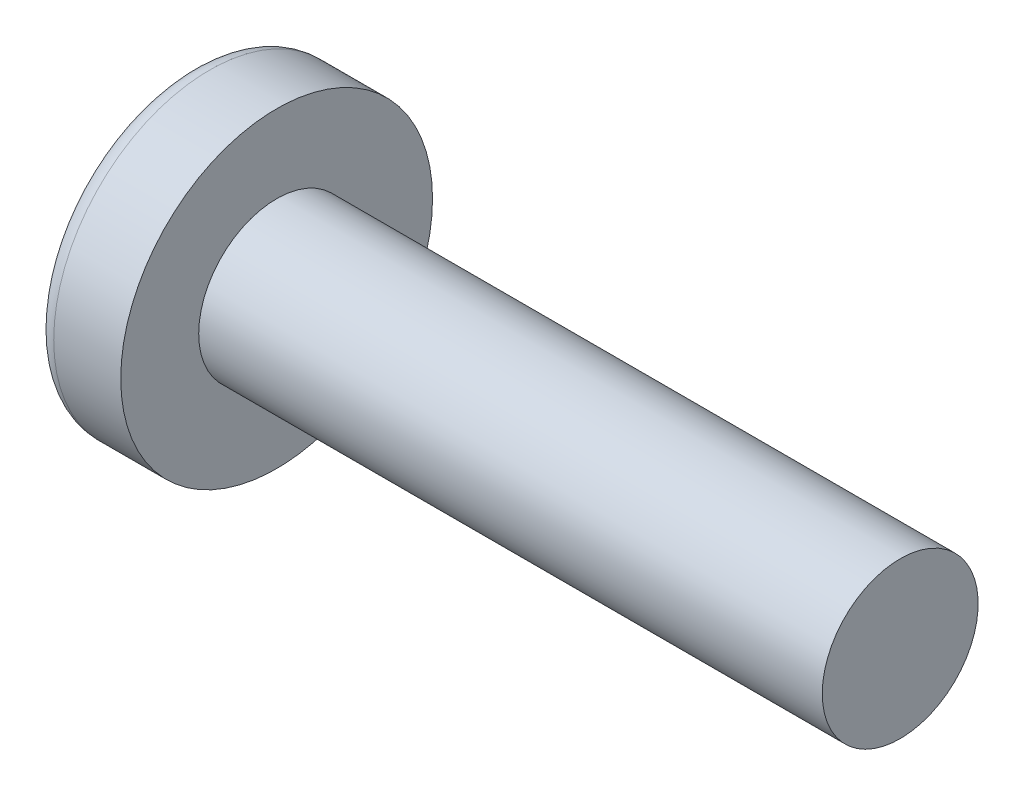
ISO-10303-21;
HEADER;
FILE_DESCRIPTION(('STEP AP214'),'2;1');
FILE_NAME('part.step','',(''),(''),'','','');
FILE_SCHEMA(('AUTOMOTIVE_DESIGN { 1 0 10303 214 1 1 1 1 }'));
ENDSEC;
DATA;
#1=APPLICATION_CONTEXT('core data for automotive mechanical design processes');
#2=APPLICATION_PROTOCOL_DEFINITION('international standard','automotive_design',2000,#1);
#3=PRODUCT_CONTEXT('',#1,'mechanical');
#4=PRODUCT('Part','Part','',(#3));
#5=PRODUCT_RELATED_PRODUCT_CATEGORY('part','',(#4));
#6=PRODUCT_DEFINITION_FORMATION('','',#4);
#7=PRODUCT_DEFINITION_CONTEXT('part definition',#1,'design');
#8=PRODUCT_DEFINITION('design','',#6,#7);
#9=PRODUCT_DEFINITION_SHAPE('','',#8);
#10=(LENGTH_UNIT() NAMED_UNIT(*) SI_UNIT(.MILLI.,.METRE.));
#11=(NAMED_UNIT(*) PLANE_ANGLE_UNIT() SI_UNIT($,.RADIAN.));
#12=(NAMED_UNIT(*) SI_UNIT($,.STERADIAN.) SOLID_ANGLE_UNIT());
#13=UNCERTAINTY_MEASURE_WITH_UNIT(LENGTH_MEASURE(1.E-05),#10,'distance_accuracy_value','');
#14=(GEOMETRIC_REPRESENTATION_CONTEXT(3) GLOBAL_UNCERTAINTY_ASSIGNED_CONTEXT((#13)) GLOBAL_UNIT_ASSIGNED_CONTEXT((#10,
#11,#12)) REPRESENTATION_CONTEXT('',''));
#15=CARTESIAN_POINT('',(0.,0.,0.));
#16=DIRECTION('',(0.,0.,1.));
#17=DIRECTION('',(1.,0.,0.));
#18=AXIS2_PLACEMENT_3D('',#15,#16,#17);
#19=CARTESIAN_POINT('',(4.,0.,0.));
#20=DIRECTION('',(-1.,0.,0.));
#21=DIRECTION('',(0.,1.,0.));
#22=AXIS2_PLACEMENT_3D('',#19,#20,#21);
#23=SPHERICAL_SURFACE('',#22,4.);
#24=CARTESIAN_POINT('',(0.783897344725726,0.,0.));
#25=DIRECTION('',(-1.,0.,0.));
#26=DIRECTION('',(0.,0.,1.));
#27=AXIS2_PLACEMENT_3D('',#24,#25,#26);
#28=CIRCLE('',#27,2.37837837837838);
#29=CARTESIAN_POINT('',(0.783897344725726,0.,2.37837837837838));
#30=VERTEX_POINT('',#29);
#31=EDGE_CURVE('E151',#30,#30,#28,.T.);
#32=ORIENTED_EDGE('',*,*,#31,.T.);
#33=EDGE_LOOP('',(#32));
#34=FACE_BOUND('',#33,.T.);
#35=CARTESIAN_POINT('',(3.98786118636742,-0.106127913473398,0.));
#36=DIRECTION('',(-0.11363816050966,-0.993522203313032,0.));
#37=DIRECTION('',(0.993522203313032,-0.11363816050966,0.));
#38=AXIS2_PLACEMENT_3D('',#35,#36,#37);
#39=CIRCLE('',#38,3.99857343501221);
#40=CARTESIAN_POINT('',(0.195539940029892,0.327634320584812,1.19110847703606));
#41=VERTEX_POINT('',#40);
#42=CARTESIAN_POINT('',(0.0301382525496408,0.346552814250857,0.346552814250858));
#43=VERTEX_POINT('',#42);
#44=EDGE_CURVE('E182',#41,#43,#39,.T.);
#45=ORIENTED_EDGE('',*,*,#44,.F.);
#46=CARTESIAN_POINT('',(3.17784904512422,0.,-1.07973473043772));
#47=DIRECTION('',(0.605808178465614,0.,0.795610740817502));
#48=DIRECTION('',(0.795610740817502,0.,-0.605808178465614));
#49=AXIS2_PLACEMENT_3D('',#46,#47,#48);
#50=CIRCLE('',#49,3.76274377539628);
#51=CARTESIAN_POINT('',(0.195539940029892,-0.327634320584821,1.19110847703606));
#52=VERTEX_POINT('',#51);
#53=EDGE_CURVE('E147',#41,#52,#50,.T.);
#54=ORIENTED_EDGE('',*,*,#53,.T.);
#55=CARTESIAN_POINT('',(3.98786118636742,0.106127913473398,0.));
#56=DIRECTION('',(-0.11363816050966,0.993522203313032,0.));
#57=DIRECTION('',(-0.993522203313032,-0.11363816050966,0.));
#58=AXIS2_PLACEMENT_3D('',#55,#56,#57);
#59=CIRCLE('',#58,3.99857343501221);
#60=CARTESIAN_POINT('',(0.0301382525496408,-0.346552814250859,0.346552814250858));
#61=VERTEX_POINT('',#60);
#62=EDGE_CURVE('E103',#61,#52,#59,.T.);
#63=ORIENTED_EDGE('',*,*,#62,.F.);
#64=CARTESIAN_POINT('',(3.98786118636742,0.,-0.106127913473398));
#65=DIRECTION('',(-0.11363816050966,0.,-0.993522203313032));
#66=DIRECTION('',(-0.993522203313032,0.,0.11363816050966));
#67=AXIS2_PLACEMENT_3D('',#64,#65,#66);
#68=CIRCLE('',#67,3.99857343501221);
#69=CARTESIAN_POINT('',(0.195539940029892,-1.19110847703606,0.327634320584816));
#70=VERTEX_POINT('',#69);
#71=EDGE_CURVE('E128',#70,#61,#68,.T.);
#72=ORIENTED_EDGE('',*,*,#71,.F.);
#73=CARTESIAN_POINT('',(3.17784904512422,1.07973473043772,0.));
#74=DIRECTION('',(0.605808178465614,-0.795610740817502,0.));
#75=DIRECTION('',(0.795610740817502,0.605808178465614,0.));
#76=AXIS2_PLACEMENT_3D('',#73,#74,#75);
#77=CIRCLE('',#76,3.76274377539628);
#78=CARTESIAN_POINT('',(0.195539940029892,-1.19110847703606,-0.327634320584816));
#79=VERTEX_POINT('',#78);
#80=EDGE_CURVE('E136',#70,#79,#77,.T.);
#81=ORIENTED_EDGE('',*,*,#80,.T.);
#82=CARTESIAN_POINT('',(3.98786118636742,0.,0.106127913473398));
#83=DIRECTION('',(-0.11363816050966,0.,0.993522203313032));
#84=DIRECTION('',(0.993522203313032,0.,0.11363816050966));
#85=AXIS2_PLACEMENT_3D('',#82,#83,#84);
#86=CIRCLE('',#85,3.99857343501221);
#87=CARTESIAN_POINT('',(0.0301382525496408,-0.346552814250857,-0.346552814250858));
#88=VERTEX_POINT('',#87);
#89=EDGE_CURVE('E46',#88,#79,#86,.T.);
#90=ORIENTED_EDGE('',*,*,#89,.F.);
#91=CARTESIAN_POINT('',(0.195539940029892,-0.327634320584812,-1.19110847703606));
#92=VERTEX_POINT('',#91);
#93=EDGE_CURVE('E189',#92,#88,#59,.T.);
#94=ORIENTED_EDGE('',*,*,#93,.F.);
#95=CARTESIAN_POINT('',(3.17784904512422,0.,1.07973473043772));
#96=DIRECTION('',(0.605808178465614,0.,-0.795610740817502));
#97=DIRECTION('',(-0.795610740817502,0.,-0.605808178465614));
#98=AXIS2_PLACEMENT_3D('',#95,#96,#97);
#99=CIRCLE('',#98,3.76274377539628);
#100=CARTESIAN_POINT('',(0.195539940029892,0.32763432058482,-1.19110847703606));
#101=VERTEX_POINT('',#100);
#102=EDGE_CURVE('E129',#92,#101,#99,.T.);
#103=ORIENTED_EDGE('',*,*,#102,.T.);
#104=CARTESIAN_POINT('',(0.0301382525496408,0.346552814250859,-0.346552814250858));
#105=VERTEX_POINT('',#104);
#106=EDGE_CURVE('E177',#105,#101,#39,.T.);
#107=ORIENTED_EDGE('',*,*,#106,.F.);
#108=CARTESIAN_POINT('',(0.195539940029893,1.19110847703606,-0.327634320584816));
#109=VERTEX_POINT('',#108);
#110=EDGE_CURVE('E39',#109,#105,#86,.T.);
#111=ORIENTED_EDGE('',*,*,#110,.F.);
#112=CARTESIAN_POINT('',(3.17784904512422,-1.07973473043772,0.));
#113=DIRECTION('',(0.605808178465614,0.795610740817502,0.));
#114=DIRECTION('',(-0.795610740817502,0.605808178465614,0.));
#115=AXIS2_PLACEMENT_3D('',#112,#113,#114);
#116=CIRCLE('',#115,3.76274377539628);
#117=CARTESIAN_POINT('',(0.195539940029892,1.19110847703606,0.327634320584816));
#118=VERTEX_POINT('',#117);
#119=EDGE_CURVE('E11',#109,#118,#116,.T.);
#120=ORIENTED_EDGE('',*,*,#119,.T.);
#121=EDGE_CURVE('E165',#43,#118,#68,.T.);
#122=ORIENTED_EDGE('',*,*,#121,.F.);
#123=EDGE_LOOP('',(#45,#54,#63,#72,#81,#90,#94,#103,#107,#111,#120,#122));
#124=FACE_BOUND('',#123,.T.);
#125=ADVANCED_FACE('F31',(#34,#124),#23,.T.);
#126=CARTESIAN_POINT('',(1.75982832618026,0.,-0.148712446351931));
#127=DIRECTION('',(-0.11363816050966,0.,0.993522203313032));
#128=DIRECTION('',(0.993522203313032,0.,0.11363816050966));
#129=AXIS2_PLACEMENT_3D('',#126,#127,#128);
#130=PLANE('',#129);
#131=ORIENTED_EDGE('',*,*,#110,.T.);
#132=DIRECTION('',(0.987168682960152,-0.112911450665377,0.112911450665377));
#133=VECTOR('',#132,1.);
#134=CARTESIAN_POINT('',(1.77640420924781,0.14681651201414,-0.146816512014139));
#135=LINE('',#134,#133);
#136=CARTESIAN_POINT('',(1.53,0.175000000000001,-0.174999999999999));
#137=VERTEX_POINT('',#136);
#138=EDGE_CURVE('E171',#105,#137,#135,.T.);
#139=ORIENTED_EDGE('',*,*,#138,.T.);
#140=DIRECTION('',(0.792336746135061,-0.603315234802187,0.0906267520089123));
#141=VECTOR('',#140,1.);
#142=CARTESIAN_POINT('',(0.,1.34,-0.35));
#143=LINE('',#142,#141);
#144=EDGE_CURVE('E152',#109,#137,#143,.T.);
#145=ORIENTED_EDGE('',*,*,#144,.F.);
#146=EDGE_LOOP('',(#131,#139,#145));
#147=FACE_BOUND('',#146,.T.);
#148=ADVANCED_FACE('F170',(#147),#130,.T.);
#149=DIRECTION('',(0.792336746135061,0.603315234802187,0.0906267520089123));
#150=VECTOR('',#149,1.);
#151=CARTESIAN_POINT('',(0.,-1.34,-0.35));
#152=LINE('',#151,#150);
#153=CARTESIAN_POINT('',(1.53,-0.175,-0.175));
#154=VERTEX_POINT('',#153);
#155=EDGE_CURVE('E137',#79,#154,#152,.T.);
#156=ORIENTED_EDGE('',*,*,#155,.T.);
#157=DIRECTION('',(-0.987168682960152,-0.112911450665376,-0.112911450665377));
#158=VECTOR('',#157,1.);
#159=CARTESIAN_POINT('',(1.77640420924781,-0.146816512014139,-0.146816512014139));
#160=LINE('',#159,#158);
#161=EDGE_CURVE('E192',#154,#88,#160,.T.);
#162=ORIENTED_EDGE('',*,*,#161,.T.);
#163=ORIENTED_EDGE('',*,*,#89,.T.);
#164=EDGE_LOOP('',(#156,#162,#163));
#165=FACE_BOUND('',#164,.T.);
#166=ADVANCED_FACE('F207',(#165),#130,.T.);
#167=CARTESIAN_POINT('',(1.75982832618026,0.,0.148712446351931));
#168=DIRECTION('',(-0.11363816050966,0.,-0.993522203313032));
#169=DIRECTION('',(-0.993522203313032,0.,0.11363816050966));
#170=AXIS2_PLACEMENT_3D('',#167,#168,#169);
#171=PLANE('',#170);
#172=DIRECTION('',(0.792336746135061,-0.603315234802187,-0.0906267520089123));
#173=VECTOR('',#172,1.);
#174=CARTESIAN_POINT('',(0.,1.34,0.35));
#175=LINE('',#174,#173);
#176=CARTESIAN_POINT('',(1.53,0.175,0.175));
#177=VERTEX_POINT('',#176);
#178=EDGE_CURVE('E208',#118,#177,#175,.T.);
#179=ORIENTED_EDGE('',*,*,#178,.T.);
#180=DIRECTION('',(-0.987168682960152,0.112911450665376,0.112911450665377));
#181=VECTOR('',#180,1.);
#182=CARTESIAN_POINT('',(1.77640420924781,0.146816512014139,0.146816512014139));
#183=LINE('',#182,#181);
#184=EDGE_CURVE('E186',#177,#43,#183,.T.);
#185=ORIENTED_EDGE('',*,*,#184,.T.);
#186=ORIENTED_EDGE('',*,*,#121,.T.);
#187=EDGE_LOOP('',(#179,#185,#186));
#188=FACE_BOUND('',#187,.T.);
#189=ADVANCED_FACE('F212',(#188),#171,.T.);
#190=ORIENTED_EDGE('',*,*,#71,.T.);
#191=DIRECTION('',(0.987168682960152,0.112911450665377,-0.112911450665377));
#192=VECTOR('',#191,1.);
#193=CARTESIAN_POINT('',(1.77640420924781,-0.14681651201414,0.146816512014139));
#194=LINE('',#193,#192);
#195=CARTESIAN_POINT('',(1.53,-0.175000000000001,0.174999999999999));
#196=VERTEX_POINT('',#195);
#197=EDGE_CURVE('E101',#61,#196,#194,.T.);
#198=ORIENTED_EDGE('',*,*,#197,.T.);
#199=DIRECTION('',(0.792336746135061,0.603315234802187,-0.0906267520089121));
#200=VECTOR('',#199,1.);
#201=CARTESIAN_POINT('',(0.,-1.34,0.35));
#202=LINE('',#201,#200);
#203=EDGE_CURVE('E126',#70,#196,#202,.T.);
#204=ORIENTED_EDGE('',*,*,#203,.F.);
#205=EDGE_LOOP('',(#190,#198,#204));
#206=FACE_BOUND('',#205,.T.);
#207=ADVANCED_FACE('F125',(#206),#171,.T.);
#208=CARTESIAN_POINT('',(-25.4,0.,0.));
#209=DIRECTION('',(-1.,0.,0.));
#210=DIRECTION('',(0.,0.,1.));
#211=AXIS2_PLACEMENT_3D('',#208,#209,#210);
#212=CYLINDRICAL_SURFACE('',#211,1.25);
#213=CARTESIAN_POINT('',(12.1,0.,0.));
#214=DIRECTION('',(-1.,0.,0.));
#215=DIRECTION('',(0.,0.,1.));
#216=AXIS2_PLACEMENT_3D('',#213,#214,#215);
#217=CIRCLE('',#216,1.25);
#218=CARTESIAN_POINT('',(12.1,0.,1.25));
#219=VERTEX_POINT('',#218);
#220=EDGE_CURVE('E148',#219,#219,#217,.T.);
#221=ORIENTED_EDGE('',*,*,#220,.T.);
#222=EDGE_LOOP('',(#221));
#223=FACE_BOUND('',#222,.T.);
#224=CARTESIAN_POINT('',(2.1,0.,0.));
#225=DIRECTION('',(-1.,0.,0.));
#226=DIRECTION('',(0.,0.,1.));
#227=AXIS2_PLACEMENT_3D('',#224,#225,#226);
#228=CIRCLE('',#227,1.25);
#229=CARTESIAN_POINT('',(2.1,0.,1.25));
#230=VERTEX_POINT('',#229);
#231=EDGE_CURVE('E161',#230,#230,#228,.T.);
#232=ORIENTED_EDGE('',*,*,#231,.F.);
#233=EDGE_LOOP('',(#232));
#234=FACE_BOUND('',#233,.T.);
#235=ADVANCED_FACE('F33',(#223,#234),#212,.T.);
#236=CARTESIAN_POINT('',(2.1,1.25,0.));
#237=DIRECTION('',(-1.,0.,0.));
#238=DIRECTION('',(0.,0.,1.));
#239=AXIS2_PLACEMENT_3D('',#236,#237,#238);
#240=PLANE('',#239);
#241=CARTESIAN_POINT('',(2.1,0.,0.));
#242=DIRECTION('',(-1.,0.,0.));
#243=DIRECTION('',(0.,0.,1.));
#244=AXIS2_PLACEMENT_3D('',#241,#242,#243);
#245=CIRCLE('',#244,2.5);
#246=CARTESIAN_POINT('',(2.1,0.,2.5));
#247=VERTEX_POINT('',#246);
#248=EDGE_CURVE('E158',#247,#247,#245,.T.);
#249=ORIENTED_EDGE('',*,*,#248,.F.);
#250=EDGE_LOOP('',(#249));
#251=FACE_BOUND('',#250,.T.);
#252=ORIENTED_EDGE('',*,*,#231,.T.);
#253=EDGE_LOOP('',(#252));
#254=FACE_BOUND('',#253,.T.);
#255=ADVANCED_FACE('F240',(#251,#254),#240,.F.);
#256=CARTESIAN_POINT('',(-25.4,0.,0.));
#257=DIRECTION('',(-1.,0.,0.));
#258=DIRECTION('',(0.,0.,1.));
#259=AXIS2_PLACEMENT_3D('',#256,#257,#258);
#260=CYLINDRICAL_SURFACE('',#259,2.5);
#261=ORIENTED_EDGE('',*,*,#248,.T.);
#262=EDGE_LOOP('',(#261));
#263=FACE_BOUND('',#262,.T.);
#264=CARTESIAN_POINT('',(1.0251050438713,0.,0.));
#265=DIRECTION('',(-1.,0.,0.));
#266=DIRECTION('',(0.,0.,1.));
#267=AXIS2_PLACEMENT_3D('',#264,#265,#266);
#268=CIRCLE('',#267,2.5);
#269=CARTESIAN_POINT('',(1.0251050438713,0.,2.5));
#270=VERTEX_POINT('',#269);
#271=EDGE_CURVE('E155',#270,#270,#268,.T.);
#272=ORIENTED_EDGE('',*,*,#271,.F.);
#273=EDGE_LOOP('',(#272));
#274=FACE_BOUND('',#273,.T.);
#275=ADVANCED_FACE('F237',(#263,#274),#260,.T.);
#276=CARTESIAN_POINT('',(1.0251050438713,0.,0.));
#277=DIRECTION('',(-1.,0.,0.));
#278=DIRECTION('',(0.,0.,1.));
#279=AXIS2_PLACEMENT_3D('',#276,#277,#278);
#280=TOROIDAL_SURFACE('',#279,2.2,0.3);
#281=ORIENTED_EDGE('',*,*,#271,.T.);
#282=EDGE_LOOP('',(#281));
#283=FACE_BOUND('',#282,.T.);
#284=ORIENTED_EDGE('',*,*,#31,.F.);
#285=EDGE_LOOP('',(#284));
#286=FACE_BOUND('',#285,.T.);
#287=ADVANCED_FACE('F234',(#283,#286),#280,.T.);
#288=CARTESIAN_POINT('',(12.1,1.25,0.));
#289=DIRECTION('',(1.,0.,0.));
#290=DIRECTION('',(0.,0.,-1.));
#291=AXIS2_PLACEMENT_3D('',#288,#289,#290);
#292=PLANE('',#291);
#293=ORIENTED_EDGE('',*,*,#220,.F.);
#294=EDGE_LOOP('',(#293));
#295=FACE_BOUND('',#294,.T.);
#296=ADVANCED_FACE('F232',(#295),#292,.T.);
#297=CARTESIAN_POINT('',(1.53,0.175,0.175));
#298=DIRECTION('',(0.605808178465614,0.795610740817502,0.));
#299=DIRECTION('',(-0.795610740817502,0.605808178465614,0.));
#300=AXIS2_PLACEMENT_3D('',#297,#298,#299);
#301=PLANE('',#300);
#302=ORIENTED_EDGE('',*,*,#144,.T.);
#303=DIRECTION('',(0.,0.,-1.));
#304=VECTOR('',#303,1.);
#305=CARTESIAN_POINT('',(1.53,0.175,0.175));
#306=LINE('',#305,#304);
#307=EDGE_CURVE('E119',#177,#137,#306,.T.);
#308=ORIENTED_EDGE('',*,*,#307,.F.);
#309=ORIENTED_EDGE('',*,*,#178,.F.);
#310=ORIENTED_EDGE('',*,*,#119,.F.);
#311=EDGE_LOOP('',(#302,#308,#309,#310));
#312=FACE_BOUND('',#311,.T.);
#313=ADVANCED_FACE('F211',(#312),#301,.F.);
#314=CARTESIAN_POINT('',(1.53,-0.175,-0.175));
#315=DIRECTION('',(0.605808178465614,-0.795610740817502,0.));
#316=DIRECTION('',(0.795610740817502,0.605808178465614,0.));
#317=AXIS2_PLACEMENT_3D('',#314,#315,#316);
#318=PLANE('',#317);
#319=ORIENTED_EDGE('',*,*,#203,.T.);
#320=DIRECTION('',(0.,0.,1.));
#321=VECTOR('',#320,1.);
#322=CARTESIAN_POINT('',(1.53,-0.175,-0.175));
#323=LINE('',#322,#321);
#324=EDGE_CURVE('E118',#154,#196,#323,.T.);
#325=ORIENTED_EDGE('',*,*,#324,.F.);
#326=ORIENTED_EDGE('',*,*,#155,.F.);
#327=ORIENTED_EDGE('',*,*,#80,.F.);
#328=EDGE_LOOP('',(#319,#325,#326,#327));
#329=FACE_BOUND('',#328,.T.);
#330=ADVANCED_FACE('F133',(#329),#318,.F.);
#331=CARTESIAN_POINT('',(1.53,0.175,-0.175));
#332=DIRECTION('',(-1.,0.,0.));
#333=DIRECTION('',(0.,0.,1.));
#334=AXIS2_PLACEMENT_3D('',#331,#332,#333);
#335=PLANE('',#334);
#336=DIRECTION('',(0.,1.,0.));
#337=VECTOR('',#336,1.);
#338=CARTESIAN_POINT('',(1.53,-0.175,-0.175));
#339=LINE('',#338,#337);
#340=EDGE_CURVE('E141',#154,#137,#339,.T.);
#341=ORIENTED_EDGE('',*,*,#340,.F.);
#342=ORIENTED_EDGE('',*,*,#324,.T.);
#343=DIRECTION('',(0.,-1.,0.));
#344=VECTOR('',#343,1.);
#345=CARTESIAN_POINT('',(1.53,0.175,0.175));
#346=LINE('',#345,#344);
#347=EDGE_CURVE('E110',#177,#196,#346,.T.);
#348=ORIENTED_EDGE('',*,*,#347,.F.);
#349=ORIENTED_EDGE('',*,*,#307,.T.);
#350=EDGE_LOOP('',(#341,#342,#348,#349));
#351=FACE_BOUND('',#350,.T.);
#352=ADVANCED_FACE('F139',(#351),#335,.T.);
#353=CARTESIAN_POINT('',(1.53,0.175000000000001,-0.174999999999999));
#354=DIRECTION('',(0.605808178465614,0.,-0.795610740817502));
#355=DIRECTION('',(0.795610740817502,0.,0.605808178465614));
#356=AXIS2_PLACEMENT_3D('',#353,#354,#355);
#357=PLANE('',#356);
#358=DIRECTION('',(0.792336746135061,0.09062675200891,0.603315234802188));
#359=VECTOR('',#358,1.);
#360=CARTESIAN_POINT('',(0.,-0.349999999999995,-1.34));
#361=LINE('',#360,#359);
#362=EDGE_CURVE('E197',#92,#154,#361,.T.);
#363=ORIENTED_EDGE('',*,*,#362,.T.);
#364=ORIENTED_EDGE('',*,*,#340,.T.);
#365=DIRECTION('',(0.792336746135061,-0.0906267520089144,0.603315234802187));
#366=VECTOR('',#365,1.);
#367=CARTESIAN_POINT('',(0.,0.350000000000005,-1.34));
#368=LINE('',#367,#366);
#369=EDGE_CURVE('E107',#101,#137,#368,.T.);
#370=ORIENTED_EDGE('',*,*,#369,.F.);
#371=ORIENTED_EDGE('',*,*,#102,.F.);
#372=EDGE_LOOP('',(#363,#364,#370,#371));
#373=FACE_BOUND('',#372,.T.);
#374=ADVANCED_FACE('F202',(#373),#357,.F.);
#375=CARTESIAN_POINT('',(1.75982832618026,-0.148712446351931,0.));
#376=DIRECTION('',(-0.11363816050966,0.993522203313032,0.));
#377=DIRECTION('',(-0.993522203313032,-0.11363816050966,0.));
#378=AXIS2_PLACEMENT_3D('',#375,#376,#377);
#379=PLANE('',#378);
#380=ORIENTED_EDGE('',*,*,#93,.T.);
#381=ORIENTED_EDGE('',*,*,#161,.F.);
#382=ORIENTED_EDGE('',*,*,#362,.F.);
#383=EDGE_LOOP('',(#380,#381,#382));
#384=FACE_BOUND('',#383,.T.);
#385=ADVANCED_FACE('F206',(#384),#379,.T.);
#386=CARTESIAN_POINT('',(1.75982832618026,0.148712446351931,0.));
#387=DIRECTION('',(-0.11363816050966,-0.993522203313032,0.));
#388=DIRECTION('',(0.993522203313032,-0.11363816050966,0.));
#389=AXIS2_PLACEMENT_3D('',#386,#387,#388);
#390=PLANE('',#389);
#391=ORIENTED_EDGE('',*,*,#106,.T.);
#392=ORIENTED_EDGE('',*,*,#369,.T.);
#393=ORIENTED_EDGE('',*,*,#138,.F.);
#394=EDGE_LOOP('',(#391,#392,#393));
#395=FACE_BOUND('',#394,.T.);
#396=ADVANCED_FACE('F200',(#395),#390,.T.);
#397=CARTESIAN_POINT('',(1.53,-0.175000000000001,0.174999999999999));
#398=DIRECTION('',(0.605808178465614,0.,0.795610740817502));
#399=DIRECTION('',(-0.795610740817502,0.,0.605808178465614));
#400=AXIS2_PLACEMENT_3D('',#397,#398,#399);
#401=PLANE('',#400);
#402=DIRECTION('',(0.792336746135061,-0.0906267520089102,-0.603315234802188));
#403=VECTOR('',#402,1.);
#404=CARTESIAN_POINT('',(0.,0.349999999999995,1.34));
#405=LINE('',#404,#403);
#406=EDGE_CURVE('E106',#41,#177,#405,.T.);
#407=ORIENTED_EDGE('',*,*,#406,.T.);
#408=ORIENTED_EDGE('',*,*,#347,.T.);
#409=DIRECTION('',(0.792336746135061,0.0906267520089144,-0.603315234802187));
#410=VECTOR('',#409,1.);
#411=CARTESIAN_POINT('',(0.,-0.350000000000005,1.34));
#412=LINE('',#411,#410);
#413=EDGE_CURVE('E97',#52,#196,#412,.T.);
#414=ORIENTED_EDGE('',*,*,#413,.F.);
#415=ORIENTED_EDGE('',*,*,#53,.F.);
#416=EDGE_LOOP('',(#407,#408,#414,#415));
#417=FACE_BOUND('',#416,.T.);
#418=ADVANCED_FACE('F111',(#417),#401,.F.);
#419=ORIENTED_EDGE('',*,*,#44,.T.);
#420=ORIENTED_EDGE('',*,*,#184,.F.);
#421=ORIENTED_EDGE('',*,*,#406,.F.);
#422=EDGE_LOOP('',(#419,#420,#421));
#423=FACE_BOUND('',#422,.T.);
#424=ADVANCED_FACE('F213',(#423),#390,.T.);
#425=ORIENTED_EDGE('',*,*,#62,.T.);
#426=ORIENTED_EDGE('',*,*,#413,.T.);
#427=ORIENTED_EDGE('',*,*,#197,.F.);
#428=EDGE_LOOP('',(#425,#426,#427));
#429=FACE_BOUND('',#428,.T.);
#430=ADVANCED_FACE('F99',(#429),#379,.T.);
#431=CLOSED_SHELL('',(#125,#148,#166,#189,#207,#235,#255,#275,#287,#296,#313,#330,#352,#374,
#385,#396,#418,#424,#430));
#432=MANIFOLD_SOLID_BREP('B2',#431);
#433=ADVANCED_BREP_SHAPE_REPRESENTATION('',(#18,#432),#14);
#434=SHAPE_DEFINITION_REPRESENTATION(#9,#433);
ENDSEC;
END-ISO-10303-21;
